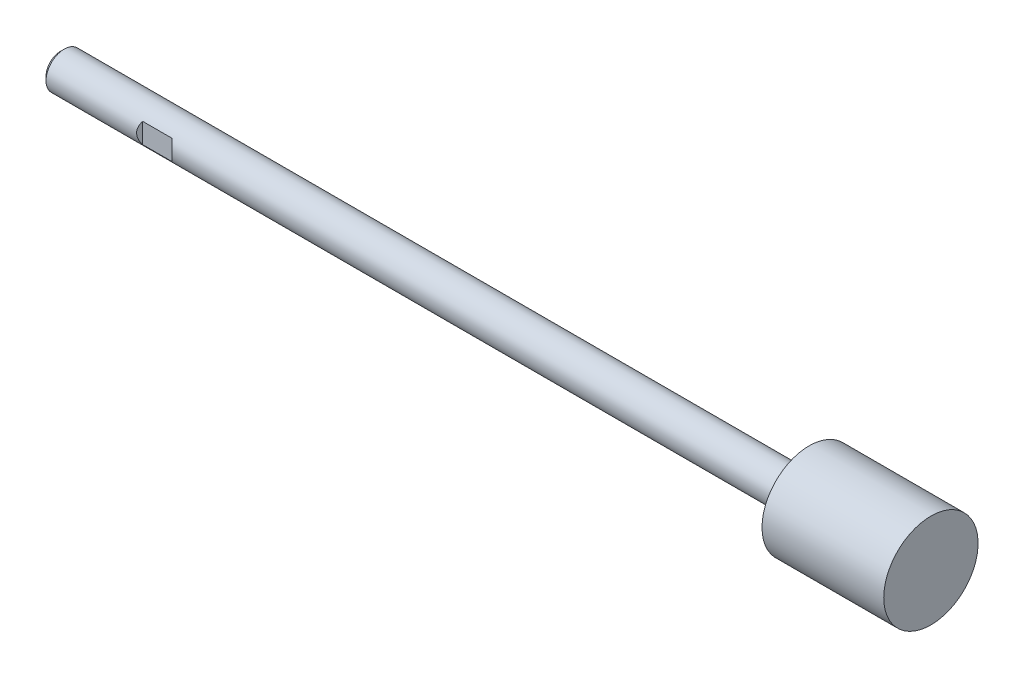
ISO-10303-21;
HEADER;
FILE_DESCRIPTION(('STEP AP214'),'2;1');
FILE_NAME('part.step','',(''),(''),'','','');
FILE_SCHEMA(('AUTOMOTIVE_DESIGN { 1 0 10303 214 1 1 1 1 }'));
ENDSEC;
DATA;
#1=APPLICATION_CONTEXT('core data for automotive mechanical design processes');
#2=APPLICATION_PROTOCOL_DEFINITION('international standard','automotive_design',2000,#1);
#3=PRODUCT_CONTEXT('',#1,'mechanical');
#4=PRODUCT('Part','Part','',(#3));
#5=PRODUCT_RELATED_PRODUCT_CATEGORY('part','',(#4));
#6=PRODUCT_DEFINITION_FORMATION('','',#4);
#7=PRODUCT_DEFINITION_CONTEXT('part definition',#1,'design');
#8=PRODUCT_DEFINITION('design','',#6,#7);
#9=PRODUCT_DEFINITION_SHAPE('','',#8);
#10=(LENGTH_UNIT() NAMED_UNIT(*) SI_UNIT(.MILLI.,.METRE.));
#11=(NAMED_UNIT(*) PLANE_ANGLE_UNIT() SI_UNIT($,.RADIAN.));
#12=(NAMED_UNIT(*) SI_UNIT($,.STERADIAN.) SOLID_ANGLE_UNIT());
#13=UNCERTAINTY_MEASURE_WITH_UNIT(LENGTH_MEASURE(1.E-05),#10,'distance_accuracy_value','');
#14=(GEOMETRIC_REPRESENTATION_CONTEXT(3) GLOBAL_UNCERTAINTY_ASSIGNED_CONTEXT((#13)) GLOBAL_UNIT_ASSIGNED_CONTEXT((#10,
#11,#12)) REPRESENTATION_CONTEXT('',''));
#15=CARTESIAN_POINT('',(0.,0.,0.));
#16=DIRECTION('',(0.,0.,1.));
#17=DIRECTION('',(1.,0.,0.));
#18=AXIS2_PLACEMENT_3D('',#15,#16,#17);
#19=CARTESIAN_POINT('',(0.,0.,0.));
#20=DIRECTION('',(1.,0.,0.));
#21=DIRECTION('',(0.,0.,-1.));
#22=AXIS2_PLACEMENT_3D('',#19,#20,#21);
#23=PLANE('',#22);
#24=CARTESIAN_POINT('',(0.,0.,0.));
#25=DIRECTION('',(-1.,0.,0.));
#26=DIRECTION('',(0.,0.,1.));
#27=AXIS2_PLACEMENT_3D('',#24,#25,#26);
#28=CIRCLE('',#27,2.3865);
#29=CARTESIAN_POINT('',(0.,0.,2.3865));
#30=VERTEX_POINT('',#29);
#31=EDGE_CURVE('E60',#30,#30,#28,.T.);
#32=ORIENTED_EDGE('',*,*,#31,.T.);
#33=EDGE_LOOP('',(#32));
#34=FACE_BOUND('',#33,.T.);
#35=ADVANCED_FACE('F16',(#34),#23,.F.);
#36=CARTESIAN_POINT('',(0.613499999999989,0.,0.));
#37=DIRECTION('',(1.,0.,0.));
#38=DIRECTION('',(0.,0.,-1.));
#39=AXIS2_PLACEMENT_3D('',#36,#37,#38);
#40=CONICAL_SURFACE('',#39,3.,0.785398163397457);
#41=ORIENTED_EDGE('',*,*,#31,.F.);
#42=EDGE_LOOP('',(#41));
#43=FACE_BOUND('',#42,.T.);
#44=CARTESIAN_POINT('',(0.613499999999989,0.,0.));
#45=DIRECTION('',(-1.,0.,0.));
#46=DIRECTION('',(0.,0.,1.));
#47=AXIS2_PLACEMENT_3D('',#44,#45,#46);
#48=CIRCLE('',#47,3.);
#49=CARTESIAN_POINT('',(0.613499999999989,0.,3.));
#50=VERTEX_POINT('',#49);
#51=EDGE_CURVE('E105',#50,#50,#48,.T.);
#52=ORIENTED_EDGE('',*,*,#51,.T.);
#53=EDGE_LOOP('',(#52));
#54=FACE_BOUND('',#53,.T.);
#55=ADVANCED_FACE('F111',(#43,#54),#40,.T.);
#56=CARTESIAN_POINT('',(143.,0.,0.));
#57=DIRECTION('',(-1.,0.,0.));
#58=DIRECTION('',(0.,0.,1.));
#59=AXIS2_PLACEMENT_3D('',#56,#57,#58);
#60=CYLINDRICAL_SURFACE('',#59,3.);
#61=DIRECTION('',(-1.,0.,0.));
#62=VECTOR('',#61,1.);
#63=CARTESIAN_POINT('',(143.,-1.6583123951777,-2.5));
#64=LINE('',#63,#62);
#65=CARTESIAN_POINT('',(16.,-1.65831239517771,-2.5));
#66=VERTEX_POINT('',#65);
#67=CARTESIAN_POINT('',(20.8,-1.6583123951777,-2.5));
#68=VERTEX_POINT('',#67);
#69=EDGE_CURVE('E81',#66,#68,#64,.F.);
#70=ORIENTED_EDGE('',*,*,#69,.T.);
#71=CARTESIAN_POINT('',(18.3,0.,0.));
#72=DIRECTION('',(0.707106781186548,0.,0.707106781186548));
#73=DIRECTION('',(-0.707106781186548,0.,0.707106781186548));
#74=AXIS2_PLACEMENT_3D('',#71,#72,#73);
#75=ELLIPSE('',#74,4.24264068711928,3.);
#76=CARTESIAN_POINT('',(20.8,1.6583123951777,-2.5));
#77=VERTEX_POINT('',#76);
#78=EDGE_CURVE('E11',#68,#77,#75,.T.);
#79=ORIENTED_EDGE('',*,*,#78,.T.);
#80=DIRECTION('',(-1.,0.,0.));
#81=VECTOR('',#80,1.);
#82=CARTESIAN_POINT('',(143.,1.6583123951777,-2.5));
#83=LINE('',#82,#81);
#84=CARTESIAN_POINT('',(16.,1.65831239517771,-2.5));
#85=VERTEX_POINT('',#84);
#86=EDGE_CURVE('E23',#77,#85,#83,.T.);
#87=ORIENTED_EDGE('',*,*,#86,.T.);
#88=CARTESIAN_POINT('',(18.5,0.,0.));
#89=DIRECTION('',(-0.707106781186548,0.,0.707106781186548));
#90=DIRECTION('',(-0.707106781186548,0.,-0.707106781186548));
#91=AXIS2_PLACEMENT_3D('',#88,#89,#90);
#92=ELLIPSE('',#91,4.24264068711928,3.);
#93=EDGE_CURVE('E78',#85,#66,#92,.T.);
#94=ORIENTED_EDGE('',*,*,#93,.T.);
#95=EDGE_LOOP('',(#70,#79,#87,#94));
#96=FACE_BOUND('',#95,.T.);
#97=DIRECTION('',(-1.,0.,0.));
#98=VECTOR('',#97,1.);
#99=CARTESIAN_POINT('',(143.,-1.6583123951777,2.5));
#100=LINE('',#99,#98);
#101=CARTESIAN_POINT('',(20.8,-1.6583123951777,2.5));
#102=VERTEX_POINT('',#101);
#103=CARTESIAN_POINT('',(16.,-1.6583123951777,2.5));
#104=VERTEX_POINT('',#103);
#105=EDGE_CURVE('E66',#102,#104,#100,.T.);
#106=ORIENTED_EDGE('',*,*,#105,.T.);
#107=CARTESIAN_POINT('',(18.5,0.,0.));
#108=DIRECTION('',(-0.707106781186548,0.,-0.707106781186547));
#109=DIRECTION('',(-0.707106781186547,0.,0.707106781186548));
#110=AXIS2_PLACEMENT_3D('',#107,#108,#109);
#111=ELLIPSE('',#110,4.24264068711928,3.);
#112=CARTESIAN_POINT('',(16.,1.6583123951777,2.5));
#113=VERTEX_POINT('',#112);
#114=EDGE_CURVE('E72',#104,#113,#111,.T.);
#115=ORIENTED_EDGE('',*,*,#114,.T.);
#116=DIRECTION('',(-1.,0.,0.));
#117=VECTOR('',#116,1.);
#118=CARTESIAN_POINT('',(143.,1.6583123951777,2.5));
#119=LINE('',#118,#117);
#120=CARTESIAN_POINT('',(20.8,1.6583123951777,2.5));
#121=VERTEX_POINT('',#120);
#122=EDGE_CURVE('E59',#113,#121,#119,.F.);
#123=ORIENTED_EDGE('',*,*,#122,.T.);
#124=CARTESIAN_POINT('',(18.3,0.,0.));
#125=DIRECTION('',(0.707106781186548,0.,-0.707106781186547));
#126=DIRECTION('',(-0.707106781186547,0.,-0.707106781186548));
#127=AXIS2_PLACEMENT_3D('',#124,#125,#126);
#128=ELLIPSE('',#127,4.24264068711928,3.);
#129=EDGE_CURVE('E54',#121,#102,#128,.T.);
#130=ORIENTED_EDGE('',*,*,#129,.T.);
#131=EDGE_LOOP('',(#106,#115,#123,#130));
#132=FACE_BOUND('',#131,.T.);
#133=ORIENTED_EDGE('',*,*,#51,.F.);
#134=EDGE_LOOP('',(#133));
#135=FACE_BOUND('',#134,.T.);
#136=CARTESIAN_POINT('',(123.,0.,0.));
#137=DIRECTION('',(-1.,0.,0.));
#138=DIRECTION('',(0.,0.,1.));
#139=AXIS2_PLACEMENT_3D('',#136,#137,#138);
#140=CIRCLE('',#139,3.);
#141=CARTESIAN_POINT('',(123.,0.,3.));
#142=VERTEX_POINT('',#141);
#143=EDGE_CURVE('E102',#142,#142,#140,.T.);
#144=ORIENTED_EDGE('',*,*,#143,.T.);
#145=EDGE_LOOP('',(#144));
#146=FACE_BOUND('',#145,.T.);
#147=ADVANCED_FACE('F70',(#96,#132,#135,#146),#60,.T.);
#148=CARTESIAN_POINT('',(123.,3.,0.));
#149=DIRECTION('',(1.,0.,0.));
#150=DIRECTION('',(0.,0.,-1.));
#151=AXIS2_PLACEMENT_3D('',#148,#149,#150);
#152=PLANE('',#151);
#153=ORIENTED_EDGE('',*,*,#143,.F.);
#154=EDGE_LOOP('',(#153));
#155=FACE_BOUND('',#154,.T.);
#156=CARTESIAN_POINT('',(123.,0.,0.));
#157=DIRECTION('',(-1.,0.,0.));
#158=DIRECTION('',(0.,0.,1.));
#159=AXIS2_PLACEMENT_3D('',#156,#157,#158);
#160=CIRCLE('',#159,7.75);
#161=CARTESIAN_POINT('',(123.,0.,7.75));
#162=VERTEX_POINT('',#161);
#163=EDGE_CURVE('E95',#162,#162,#160,.T.);
#164=ORIENTED_EDGE('',*,*,#163,.T.);
#165=EDGE_LOOP('',(#164));
#166=FACE_BOUND('',#165,.T.);
#167=ADVANCED_FACE('F117',(#155,#166),#152,.F.);
#168=CARTESIAN_POINT('',(143.,0.,0.));
#169=DIRECTION('',(-1.,0.,0.));
#170=DIRECTION('',(0.,0.,1.));
#171=AXIS2_PLACEMENT_3D('',#168,#169,#170);
#172=CYLINDRICAL_SURFACE('',#171,7.75);
#173=ORIENTED_EDGE('',*,*,#163,.F.);
#174=EDGE_LOOP('',(#173));
#175=FACE_BOUND('',#174,.T.);
#176=CARTESIAN_POINT('',(143.,0.,0.));
#177=DIRECTION('',(-1.,0.,0.));
#178=DIRECTION('',(0.,0.,1.));
#179=AXIS2_PLACEMENT_3D('',#176,#177,#178);
#180=CIRCLE('',#179,7.75);
#181=CARTESIAN_POINT('',(143.,0.,7.75));
#182=VERTEX_POINT('',#181);
#183=EDGE_CURVE('E92',#182,#182,#180,.T.);
#184=ORIENTED_EDGE('',*,*,#183,.T.);
#185=EDGE_LOOP('',(#184));
#186=FACE_BOUND('',#185,.T.);
#187=ADVANCED_FACE('F123',(#175,#186),#172,.T.);
#188=CARTESIAN_POINT('',(143.,7.75,0.));
#189=DIRECTION('',(-1.,0.,0.));
#190=DIRECTION('',(0.,0.,1.));
#191=AXIS2_PLACEMENT_3D('',#188,#189,#190);
#192=PLANE('',#191);
#193=ORIENTED_EDGE('',*,*,#183,.F.);
#194=EDGE_LOOP('',(#193));
#195=FACE_BOUND('',#194,.T.);
#196=ADVANCED_FACE('F129',(#195),#192,.F.);
#197=CARTESIAN_POINT('',(30.3,-2.5,12.));
#198=DIRECTION('',(0.707106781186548,0.,-0.707106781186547));
#199=DIRECTION('',(-0.707106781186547,0.,-0.707106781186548));
#200=AXIS2_PLACEMENT_3D('',#197,#198,#199);
#201=PLANE('',#200);
#202=DIRECTION('',(0.,1.,0.));
#203=VECTOR('',#202,1.);
#204=CARTESIAN_POINT('',(20.8,-2.5,2.5));
#205=LINE('',#204,#203);
#206=EDGE_CURVE('E36',#102,#121,#205,.T.);
#207=ORIENTED_EDGE('',*,*,#206,.F.);
#208=ORIENTED_EDGE('',*,*,#129,.F.);
#209=EDGE_LOOP('',(#207,#208));
#210=FACE_BOUND('',#209,.T.);
#211=ADVANCED_FACE('F55',(#210),#201,.F.);
#212=CARTESIAN_POINT('',(20.8,-2.5,2.5));
#213=DIRECTION('',(0.,0.,-1.));
#214=DIRECTION('',(-1.,0.,0.));
#215=AXIS2_PLACEMENT_3D('',#212,#213,#214);
#216=PLANE('',#215);
#217=ORIENTED_EDGE('',*,*,#206,.T.);
#218=ORIENTED_EDGE('',*,*,#122,.F.);
#219=DIRECTION('',(0.,1.,0.));
#220=VECTOR('',#219,1.);
#221=CARTESIAN_POINT('',(16.,-2.5,2.5));
#222=LINE('',#221,#220);
#223=EDGE_CURVE('E67',#104,#113,#222,.T.);
#224=ORIENTED_EDGE('',*,*,#223,.F.);
#225=ORIENTED_EDGE('',*,*,#105,.F.);
#226=EDGE_LOOP('',(#217,#218,#224,#225));
#227=FACE_BOUND('',#226,.T.);
#228=ADVANCED_FACE('F63',(#227),#216,.F.);
#229=CARTESIAN_POINT('',(16.,-2.5,2.5));
#230=DIRECTION('',(-0.707106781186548,0.,-0.707106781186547));
#231=DIRECTION('',(-0.707106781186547,0.,0.707106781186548));
#232=AXIS2_PLACEMENT_3D('',#229,#230,#231);
#233=PLANE('',#232);
#234=ORIENTED_EDGE('',*,*,#223,.T.);
#235=ORIENTED_EDGE('',*,*,#114,.F.);
#236=EDGE_LOOP('',(#234,#235));
#237=FACE_BOUND('',#236,.T.);
#238=ADVANCED_FACE('F194',(#237),#233,.F.);
#239=CARTESIAN_POINT('',(20.8,-2.5,-2.5));
#240=DIRECTION('',(0.707106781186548,0.,0.707106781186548));
#241=DIRECTION('',(0.707106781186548,0.,-0.707106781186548));
#242=AXIS2_PLACEMENT_3D('',#239,#240,#241);
#243=PLANE('',#242);
#244=DIRECTION('',(0.,1.,0.));
#245=VECTOR('',#244,1.);
#246=CARTESIAN_POINT('',(20.8,-2.5,-2.5));
#247=LINE('',#246,#245);
#248=EDGE_CURVE('E89',#68,#77,#247,.T.);
#249=ORIENTED_EDGE('',*,*,#248,.T.);
#250=ORIENTED_EDGE('',*,*,#78,.F.);
#251=EDGE_LOOP('',(#249,#250));
#252=FACE_BOUND('',#251,.T.);
#253=ADVANCED_FACE('F91',(#252),#243,.F.);
#254=CARTESIAN_POINT('',(16.,-2.5,-2.5));
#255=DIRECTION('',(0.,0.,1.));
#256=DIRECTION('',(1.,0.,0.));
#257=AXIS2_PLACEMENT_3D('',#254,#255,#256);
#258=PLANE('',#257);
#259=ORIENTED_EDGE('',*,*,#248,.F.);
#260=ORIENTED_EDGE('',*,*,#69,.F.);
#261=DIRECTION('',(0.,1.,0.));
#262=VECTOR('',#261,1.);
#263=CARTESIAN_POINT('',(16.,-2.5,-2.5));
#264=LINE('',#263,#262);
#265=EDGE_CURVE('E29',#66,#85,#264,.T.);
#266=ORIENTED_EDGE('',*,*,#265,.T.);
#267=ORIENTED_EDGE('',*,*,#86,.F.);
#268=EDGE_LOOP('',(#259,#260,#266,#267));
#269=FACE_BOUND('',#268,.T.);
#270=ADVANCED_FACE('F88',(#269),#258,.F.);
#271=CARTESIAN_POINT('',(14.4,-2.5,-4.1));
#272=DIRECTION('',(-0.707106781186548,0.,0.707106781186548));
#273=DIRECTION('',(0.707106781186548,0.,0.707106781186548));
#274=AXIS2_PLACEMENT_3D('',#271,#272,#273);
#275=PLANE('',#274);
#276=ORIENTED_EDGE('',*,*,#265,.F.);
#277=ORIENTED_EDGE('',*,*,#93,.F.);
#278=EDGE_LOOP('',(#276,#277));
#279=FACE_BOUND('',#278,.T.);
#280=ADVANCED_FACE('F223',(#279),#275,.F.);
#281=CLOSED_SHELL('',(#35,#55,#147,#167,#187,#196,#211,#228,#238,#253,#270,#280));
#282=MANIFOLD_SOLID_BREP('B1',#281);
#283=ADVANCED_BREP_SHAPE_REPRESENTATION('',(#18,#282),#14);
#284=SHAPE_DEFINITION_REPRESENTATION(#9,#283);
ENDSEC;
END-ISO-10303-21;
